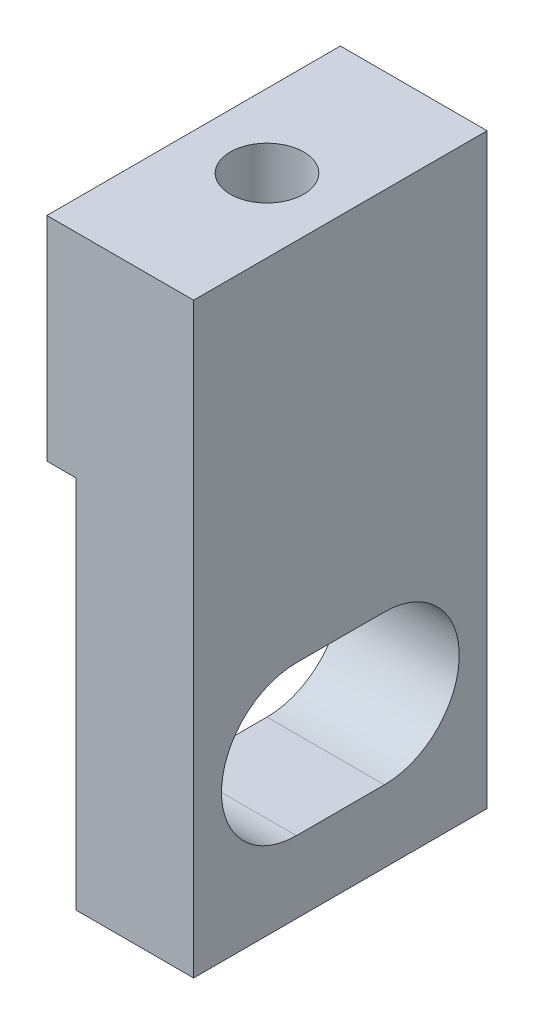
from build123d import *

# Parameters (mm, degrees)
EXTRUSION1_DEPTH          = 10
LUMIERE_H1_REACH          = 157.728
TROU_TARAUD_M6X1_01_D     = 5
TROU_TARAUD_M6X1_01_DEPTH = 16
TROU_TARAUD_M6X1_01_TIP   = 1.502151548


with BuildPart() as part:
    # Esquisse1 → Extrusion1 (new, symmetric)
    with BuildSketch(Plane.XY):
        Polygon((0, 0), (10, 0), (10, -40), (2, -40), (2, -14.5), (0, -14.5), align=None)
    extrude(amount=EXTRUSION1_DEPTH, both=True)

    # Sketch2 → lumiere H1 (cut, up to next)
    with BuildSketch(Plane(origin=(10, -113.867564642, 95.760683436), x_dir=(0, 0, -1), z_dir=(1, 0, 0)), mode=Mode.PRIVATE) as lumiere_h1_sk1:
        with BuildLine():
            Line((92.760683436, 78.767564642), (98.760683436, 78.767564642))
            ThreePointArc((98.760683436, 78.767564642), (103.860683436, 83.867564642), (98.760683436, 88.967564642))
            Line((98.760683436, 88.967564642), (92.760683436, 88.967564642))
            ThreePointArc((92.760683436, 88.967564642), (87.660683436, 83.867564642), (92.760683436, 78.767564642))
        make_face()
    lumiere_h1_tool1 = extrude(lumiere_h1_sk1.sketch, amount=-LUMIERE_H1_REACH, mode=Mode.PRIVATE) & part.part
    add(lumiere_h1_tool1.solids().sort_by_distance((10, -30, 0))[0], mode=Mode.SUBTRACT)

    # Trou taraud_ M6x1.01
    with Locations(Plane(origin=(0, 0, 0), x_dir=(-1, 0, 0), z_dir=(0, 1, 0))):
        with Locations((-5, 0)):
            Hole(TROU_TARAUD_M6X1_01_D / 2, depth=TROU_TARAUD_M6X1_01_DEPTH)
            with Locations((0, 0, -(TROU_TARAUD_M6X1_01_DEPTH + TROU_TARAUD_M6X1_01_TIP / 2))):  # 118° drill point
                Cone(0, TROU_TARAUD_M6X1_01_D / 2, TROU_TARAUD_M6X1_01_TIP, mode=Mode.SUBTRACT)


solid = part.part
